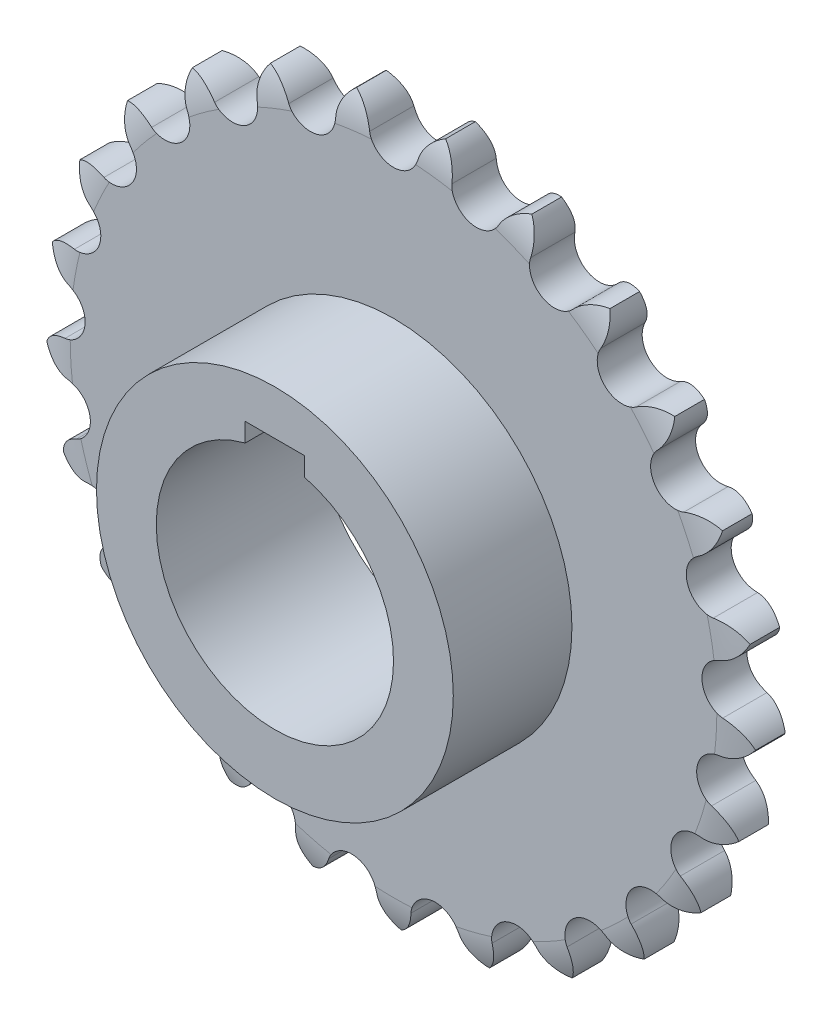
from build123d import *

# Parameters (mm, degrees)
CROQUIS1_R              = 19
SALIENTE_EXTRUIR1_DEPTH = 3.6
CROQUIS2_R              = 28.575
CROQUIS2_R_2            = 19
SALIENTE_EXTRUIR2_DEPTH = 19
CROQUIS3_W              = 9.5
CROQUIS3_H              = 4.8
CORTAR_EXTRUIR1_DEPTH   = 85.518395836


with BuildPart() as part:
    # Croquis1 → Saliente-Extruir1 (new, symmetric)
    with BuildSketch(Plane.XY):
        with BuildLine():
            ThreePointArc((3.880781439, 52.530703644), (0, 49.5), (-3.880781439, 52.530703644))
            ThreePointArc((-3.880781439, 52.530703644), (-5.058625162, 54.850631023), (-7.128405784, 56.427142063))
            ThreePointArc((-7.128405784, 56.427142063), (-8.741098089, 54.385426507), (-9.304995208, 51.84546609))
            ThreePointArc((-9.304995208, 51.84546609), (-12.310149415, 47.944866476), (-16.822714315, 49.915243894))
            ThreePointArc((-16.822714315, 49.915243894), (-18.540496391, 51.869368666), (-20.937313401, 52.881617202))
            ThreePointArc((-20.937313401, 52.881617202), (-21.991586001, 50.502985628), (-21.906104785, 47.902587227))
            ThreePointArc((-21.906104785, 47.902587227), (-23.846806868, 43.377180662), (-28.707614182, 44.163425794))
            ThreePointArc((-28.707614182, 44.163425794), (-30.857400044, 45.628963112), (-33.430652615, 46.013345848))
            ThreePointArc((-33.430652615, 46.013345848), (-33.860261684, 43.447256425), (-33.130773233, 40.949812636))
            ThreePointArc((-33.130773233, 40.949812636), (-33.885081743, 36.083947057), (-38.788709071, 35.63665723))
            ThreePointArc((-38.788709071, 35.63665723), (-41.235419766, 36.521521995), (-43.823420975, 36.253886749))
            ThreePointArc((-43.823420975, 36.253886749), (-43.601372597, 33.661576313), (-42.273713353, 31.424010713))
            ThreePointArc((-42.273713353, 31.424010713), (-41.794232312, 26.523426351), (-46.432566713, 24.87070643))
            ThreePointArc((-46.432566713, 24.87070643), (-49.022466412, 25.119299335), (-51.462602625, 24.216462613))
            ThreePointArc((-51.462602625, 24.216462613), (-50.602848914, 21.760815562), (-48.76044059, 19.923722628))
            ThreePointArc((-48.76044059, 19.923722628), (-47.077297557, 15.296341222), (-51.158895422, 12.542037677))
            ThreePointArc((-51.158895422, 12.542037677), (-53.729251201, 12.138738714), (-55.868199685, 10.657429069))
            ThreePointArc((-55.868199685, 10.657429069), (-54.42476213, 8.49274274), (-52.183370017, 7.171553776))
            ThreePointArc((-52.183370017, 7.171553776), (-49.402323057, 3.108130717), (-52.670722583, -0.57469343))
            ThreePointArc((-52.670722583, -0.57469343), (-55.060029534, -1.604543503), (-56.76339229, -3.571249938))
            ThreePointArc((-56.76339229, -3.571249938), (-54.826967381, -5.308960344), (-52.327426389, -6.031230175))
            ThreePointArc((-52.327426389, -6.031230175), (-48.623218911, -9.275375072), (-50.873054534, -13.655314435))
            ThreePointArc((-50.873054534, -13.655314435), (-52.931183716, -15.24700635), (-54.091932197, -17.575534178))
            ThreePointArc((-54.091932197, -17.575534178), (-51.784192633, -18.777081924), (-49.183558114, -18.855049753))
            ThreePointArc((-49.183558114, -18.855049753), (-44.788939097, -21.076074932), (-45.878845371, -25.877921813))
            ThreePointArc((-45.878845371, -25.877921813), (-47.476476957, -27.931443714), (-48.021677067, -30.475482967))
            ThreePointArc((-48.021677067, -30.475482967), (-45.487626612, -31.065370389), (-42.949305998, -30.49413721))
            ThreePointArc((-42.949305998, -30.49413721), (-38.140405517, -31.552487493), (-38.001899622, -36.474524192))
            ThreePointArc((-38.001899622, -36.474524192), (-39.038648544, -38.860845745), (-38.934043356, -41.46054508))
            ThreePointArc((-38.934043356, -41.46054508), (-36.332905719, -41.401707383), (-34.01639103, -40.217165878))
            ThreePointArc((-34.01639103, -40.217165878), (-29.095369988, -40.046341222), (-27.737154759, -44.779298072))
            ThreePointArc((-27.737154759, -44.779298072), (-28.14787827, -47.348477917), (-27.400040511, -49.840488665))
            ThreePointArc((-27.400040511, -49.840488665), (-24.895254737, -49.136622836), (-22.94610111, -47.413202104))
            ThreePointArc((-22.94610111, -47.413202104), (-18.222165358, -46.023936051), (-15.729582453, -50.270423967))
            ThreePointArc((-15.729582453, -50.270423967), (-15.488473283, -52.861031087), (-14.144392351, -55.088771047))
            ThreePointArc((-14.144392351, -55.088771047), (-11.893343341, -53.784103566), (-10.434023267, -51.630092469))
            ThreePointArc((-10.434023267, -51.630092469), (-6.203995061, -49.109677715), (-2.733662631, -52.602874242))
            ThreePointArc((-2.733662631, -52.602874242), (-1.855870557, -55.052131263), (0, -56.875623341))
            ThreePointArc((0, -56.875623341), (1.855870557, -55.052131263), (2.733662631, -52.602874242))
            ThreePointArc((2.733662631, -52.602874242), (6.203995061, -49.109677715), (10.434023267, -51.630092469))
            ThreePointArc((10.434023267, -51.630092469), (11.893343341, -53.784103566), (14.144392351, -55.088771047))
            ThreePointArc((14.144392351, -55.088771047), (15.488473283, -52.861031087), (15.729582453, -50.270423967))
            ThreePointArc((15.729582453, -50.270423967), (18.222165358, -46.023936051), (22.94610111, -47.413202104))
            ThreePointArc((22.94610111, -47.413202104), (24.895254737, -49.136622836), (27.400040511, -49.840488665))
            ThreePointArc((27.400040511, -49.840488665), (28.14787827, -47.348477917), (27.737154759, -44.779298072))
            ThreePointArc((27.737154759, -44.779298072), (29.095369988, -40.046341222), (34.01639103, -40.217165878))
            ThreePointArc((34.01639103, -40.217165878), (36.332905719, -41.401707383), (38.934043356, -41.46054508))
            ThreePointArc((38.934043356, -41.46054508), (39.038648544, -38.860845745), (38.001899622, -36.474524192))
            ThreePointArc((38.001899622, -36.474524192), (38.140405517, -31.552487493), (42.949305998, -30.49413721))
            ThreePointArc((42.949305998, -30.49413721), (45.487626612, -31.065370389), (48.021677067, -30.475482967))
            ThreePointArc((48.021677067, -30.475482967), (47.476476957, -27.931443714), (45.878845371, -25.877921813))
            ThreePointArc((45.878845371, -25.877921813), (44.788939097, -21.076074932), (49.183558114, -18.855049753))
            ThreePointArc((49.183558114, -18.855049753), (51.784192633, -18.777081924), (54.091932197, -17.575534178))
            ThreePointArc((54.091932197, -17.575534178), (52.931183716, -15.24700635), (50.873054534, -13.655314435))
            ThreePointArc((50.873054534, -13.655314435), (48.623218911, -9.275375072), (52.327426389, -6.031230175))
            ThreePointArc((52.327426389, -6.031230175), (54.826967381, -5.308960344), (56.76339229, -3.571249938))
            ThreePointArc((56.76339229, -3.571249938), (55.060029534, -1.604543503), (52.670722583, -0.57469343))
            ThreePointArc((52.670722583, -0.57469343), (49.402323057, 3.108130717), (52.183370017, 7.171553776))
            ThreePointArc((52.183370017, 7.171553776), (54.42476213, 8.49274274), (55.868199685, 10.657429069))
            ThreePointArc((55.868199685, 10.657429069), (53.729251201, 12.138738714), (51.158895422, 12.542037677))
            ThreePointArc((51.158895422, 12.542037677), (47.077297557, 15.296341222), (48.76044059, 19.923722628))
            ThreePointArc((48.76044059, 19.923722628), (50.602848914, 21.760815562), (51.462602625, 24.216462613))
            ThreePointArc((51.462602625, 24.216462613), (49.022466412, 25.119299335), (46.432566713, 24.87070643))
            ThreePointArc((46.432566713, 24.87070643), (41.794232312, 26.523426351), (42.273713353, 31.424010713))
            ThreePointArc((42.273713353, 31.424010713), (43.601372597, 33.661576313), (43.823420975, 36.253886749))
            ThreePointArc((43.823420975, 36.253886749), (41.235419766, 36.521521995), (38.788709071, 35.63665723))
            ThreePointArc((38.788709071, 35.63665723), (33.885081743, 36.083947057), (33.130773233, 40.949812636))
            ThreePointArc((33.130773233, 40.949812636), (33.860261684, 43.447256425), (33.430652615, 46.013345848))
            ThreePointArc((33.430652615, 46.013345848), (30.857400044, 45.628963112), (28.707614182, 44.163425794))
            ThreePointArc((28.707614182, 44.163425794), (23.846806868, 43.377180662), (21.906104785, 47.902587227))
            ThreePointArc((21.906104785, 47.902587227), (21.991586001, 50.502985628), (20.937313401, 52.881617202))
            ThreePointArc((20.937313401, 52.881617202), (18.540496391, 51.869368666), (16.822714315, 49.915243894))
            ThreePointArc((16.822714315, 49.915243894), (12.310149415, 47.944866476), (9.304995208, 51.84546609))
            ThreePointArc((9.304995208, 51.84546609), (8.741098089, 54.385426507), (7.128405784, 56.427142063))
            ThreePointArc((7.128405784, 56.427142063), (5.058625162, 54.850631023), (3.880781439, 52.530703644))
        make_face()
        Circle(CROQUIS1_R, mode=Mode.SUBTRACT)
    extrude(amount=SALIENTE_EXTRUIR1_DEPTH, both=True)

    # Croquis2 → Saliente-Extruir2 (add)
    with BuildSketch(Plane.XY.offset(3.6)):
        Circle(CROQUIS2_R)
        Circle(CROQUIS2_R_2, mode=Mode.SUBTRACT)
    extrude(amount=SALIENTE_EXTRUIR2_DEPTH)

    # Croquis3 → Cortar-Extruir1 (cut, through all)
    with BuildSketch(Plane.XY.offset(22.6)):
        with Locations((0, 19)):
            Rectangle(CROQUIS3_W, CROQUIS3_H)
    extrude(amount=-CORTAR_EXTRUIR1_DEPTH, mode=Mode.SUBTRACT)

    # Croquis4 → Cortar-Revoluci_n1 (revolve, cut)
    with BuildSketch(Plane(origin=(0, 0, 0), x_dir=(0, 0, -1), z_dir=(1, 0, 0))):
        with BuildLine():
            Line((-2.1, 57.427142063), (-6.188120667, 57.427142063))
            Line((-6.188120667, 57.427142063), (-6.188120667, 51.077142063))
            Line((-6.188120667, 51.077142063), (-3.6, 51.077142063))
            ThreePointArc((-3.6, 51.077142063), (-3.26475648, 54.350116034), (-2.1, 57.427142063))
        make_face()
        with BuildLine():
            Line((6.188120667, 51.077142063), (3.6, 51.077142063))
            ThreePointArc((3.6, 51.077142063), (3.26475648, 54.350116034), (2.1, 57.427142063))
            Line((2.1, 57.427142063), (6.188120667, 57.427142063))
            Line((6.188120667, 57.427142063), (6.188120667, 51.077142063))
        make_face()
    revolve(axis=Axis((0, 0, 22.6), (0, 0, -1)), mode=Mode.SUBTRACT)


solid = part.part
